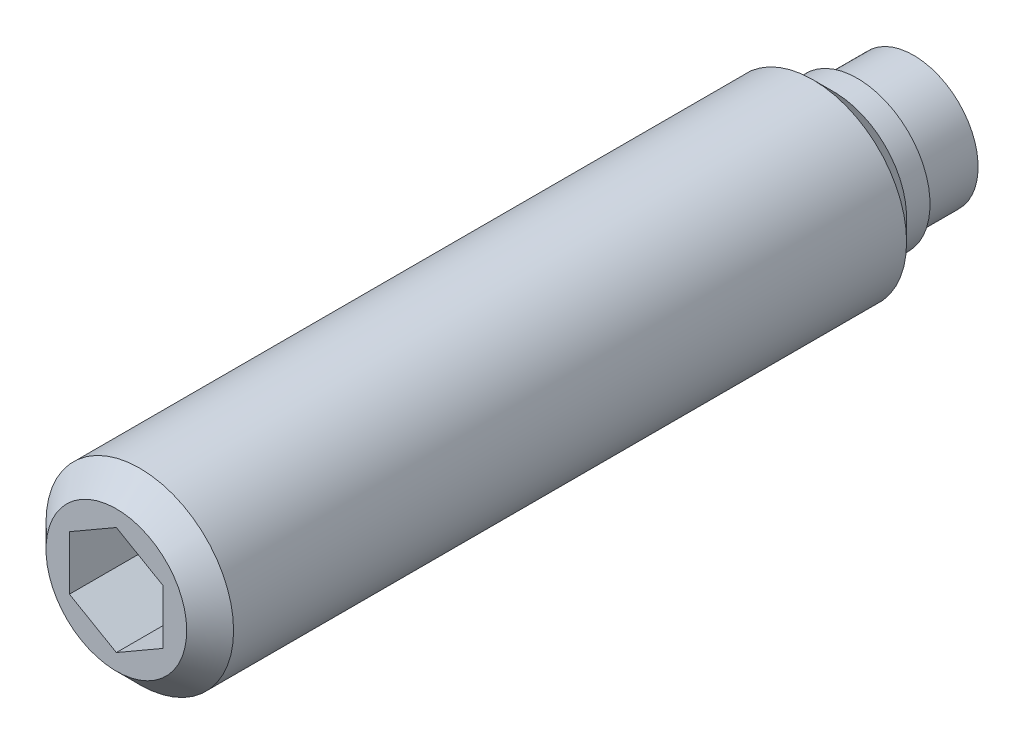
ISO-10303-21;
HEADER;
FILE_DESCRIPTION(('STEP AP214'),'2;1');
FILE_NAME('part.step','',(''),(''),'','','');
FILE_SCHEMA(('AUTOMOTIVE_DESIGN { 1 0 10303 214 1 1 1 1 }'));
ENDSEC;
DATA;
#1=APPLICATION_CONTEXT('core data for automotive mechanical design processes');
#2=APPLICATION_PROTOCOL_DEFINITION('international standard','automotive_design',2000,#1);
#3=PRODUCT_CONTEXT('',#1,'mechanical');
#4=PRODUCT('Part','Part','',(#3));
#5=PRODUCT_RELATED_PRODUCT_CATEGORY('part','',(#4));
#6=PRODUCT_DEFINITION_FORMATION('','',#4);
#7=PRODUCT_DEFINITION_CONTEXT('part definition',#1,'design');
#8=PRODUCT_DEFINITION('design','',#6,#7);
#9=PRODUCT_DEFINITION_SHAPE('','',#8);
#10=(LENGTH_UNIT() NAMED_UNIT(*) SI_UNIT(.MILLI.,.METRE.));
#11=(NAMED_UNIT(*) PLANE_ANGLE_UNIT() SI_UNIT($,.RADIAN.));
#12=(NAMED_UNIT(*) SI_UNIT($,.STERADIAN.) SOLID_ANGLE_UNIT());
#13=UNCERTAINTY_MEASURE_WITH_UNIT(LENGTH_MEASURE(1.E-05),#10,'distance_accuracy_value','');
#14=(GEOMETRIC_REPRESENTATION_CONTEXT(3) GLOBAL_UNCERTAINTY_ASSIGNED_CONTEXT((#13)) GLOBAL_UNIT_ASSIGNED_CONTEXT((#10,
#11,#12)) REPRESENTATION_CONTEXT('',''));
#15=CARTESIAN_POINT('',(0.,0.,0.));
#16=DIRECTION('',(0.,0.,1.));
#17=DIRECTION('',(1.,0.,0.));
#18=AXIS2_PLACEMENT_3D('',#15,#16,#17);
#19=CARTESIAN_POINT('',(0.,3.1,3.2));
#20=DIRECTION('',(0.,0.,1.));
#21=DIRECTION('',(1.,0.,0.));
#22=AXIS2_PLACEMENT_3D('',#19,#20,#21);
#23=PLANE('',#22);
#24=CARTESIAN_POINT('',(0.,0.,3.2));
#25=DIRECTION('',(0.,0.,-1.));
#26=DIRECTION('',(-1.,0.,0.));
#27=AXIS2_PLACEMENT_3D('',#24,#25,#26);
#28=CIRCLE('',#27,2.75);
#29=CARTESIAN_POINT('',(-2.75000000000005,0.,3.2));
#30=VERTEX_POINT('',#29);
#31=EDGE_CURVE('E124',#30,#30,#28,.T.);
#32=ORIENTED_EDGE('',*,*,#31,.F.);
#33=EDGE_LOOP('',(#32));
#34=FACE_BOUND('',#33,.T.);
#35=CARTESIAN_POINT('',(0.,0.,3.2));
#36=DIRECTION('',(0.,0.,-1.));
#37=DIRECTION('',(-1.,0.,0.));
#38=AXIS2_PLACEMENT_3D('',#35,#36,#37);
#39=CIRCLE('',#38,3.1);
#40=CARTESIAN_POINT('',(-3.10000000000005,0.,3.2));
#41=VERTEX_POINT('',#40);
#42=EDGE_CURVE('E127',#41,#41,#39,.T.);
#43=ORIENTED_EDGE('',*,*,#42,.T.);
#44=EDGE_LOOP('',(#43));
#45=FACE_BOUND('',#44,.T.);
#46=ADVANCED_FACE('F14',(#34,#45),#23,.F.);
#47=CARTESIAN_POINT('',(0.,0.,3.2));
#48=DIRECTION('',(0.,0.,-1.));
#49=DIRECTION('',(-1.,0.,0.));
#50=AXIS2_PLACEMENT_3D('',#47,#48,#49);
#51=CYLINDRICAL_SURFACE('',#50,4.);
#52=CARTESIAN_POINT('',(0.,0.,33.8));
#53=DIRECTION('',(0.,0.,1.));
#54=DIRECTION('',(1.,0.,0.));
#55=AXIS2_PLACEMENT_3D('',#52,#53,#54);
#56=CIRCLE('',#55,4.);
#57=CARTESIAN_POINT('',(3.99999999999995,0.,33.8));
#58=VERTEX_POINT('',#57);
#59=EDGE_CURVE('E9',#58,#58,#56,.F.);
#60=ORIENTED_EDGE('',*,*,#59,.T.);
#61=EDGE_LOOP('',(#60));
#62=FACE_BOUND('',#61,.T.);
#63=CARTESIAN_POINT('',(0.,0.,5.1));
#64=DIRECTION('',(0.,0.,-1.));
#65=DIRECTION('',(-1.,0.,0.));
#66=AXIS2_PLACEMENT_3D('',#63,#64,#65);
#67=CIRCLE('',#66,4.);
#68=CARTESIAN_POINT('',(-4.00000000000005,0.,5.1));
#69=VERTEX_POINT('',#68);
#70=EDGE_CURVE('E133',#69,#69,#67,.T.);
#71=ORIENTED_EDGE('',*,*,#70,.F.);
#72=EDGE_LOOP('',(#71));
#73=FACE_BOUND('',#72,.T.);
#74=ADVANCED_FACE('F151',(#62,#73),#51,.T.);
#75=CARTESIAN_POINT('',(0.,0.,5.1));
#76=DIRECTION('',(0.,0.,1.));
#77=DIRECTION('',(1.,0.,0.));
#78=AXIS2_PLACEMENT_3D('',#75,#76,#77);
#79=CONICAL_SURFACE('',#78,4.,0.785398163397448);
#80=CARTESIAN_POINT('',(0.,0.,4.2));
#81=DIRECTION('',(0.,0.,-1.));
#82=DIRECTION('',(-1.,0.,0.));
#83=AXIS2_PLACEMENT_3D('',#80,#81,#82);
#84=CIRCLE('',#83,3.1);
#85=CARTESIAN_POINT('',(-3.10000000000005,0.,4.2));
#86=VERTEX_POINT('',#85);
#87=EDGE_CURVE('E130',#86,#86,#84,.T.);
#88=ORIENTED_EDGE('',*,*,#87,.F.);
#89=EDGE_LOOP('',(#88));
#90=FACE_BOUND('',#89,.T.);
#91=ORIENTED_EDGE('',*,*,#70,.T.);
#92=EDGE_LOOP('',(#91));
#93=FACE_BOUND('',#92,.T.);
#94=ADVANCED_FACE('F158',(#90,#93),#79,.T.);
#95=CARTESIAN_POINT('',(0.,0.,3.2));
#96=DIRECTION('',(0.,0.,-1.));
#97=DIRECTION('',(-1.,0.,0.));
#98=AXIS2_PLACEMENT_3D('',#95,#96,#97);
#99=CYLINDRICAL_SURFACE('',#98,3.1);
#100=ORIENTED_EDGE('',*,*,#42,.F.);
#101=EDGE_LOOP('',(#100));
#102=FACE_BOUND('',#101,.T.);
#103=ORIENTED_EDGE('',*,*,#87,.T.);
#104=EDGE_LOOP('',(#103));
#105=FACE_BOUND('',#104,.T.);
#106=ADVANCED_FACE('F166',(#102,#105),#99,.T.);
#107=CARTESIAN_POINT('',(0.,0.,0.));
#108=DIRECTION('',(0.,0.,-1.));
#109=DIRECTION('',(-1.,0.,0.));
#110=AXIS2_PLACEMENT_3D('',#107,#108,#109);
#111=CYLINDRICAL_SURFACE('',#110,2.75);
#112=CARTESIAN_POINT('',(0.,0.,0.8));
#113=DIRECTION('',(0.,0.,-1.));
#114=DIRECTION('',(-1.,0.,0.));
#115=AXIS2_PLACEMENT_3D('',#112,#113,#114);
#116=CIRCLE('',#115,2.75);
#117=CARTESIAN_POINT('',(-2.75000000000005,0.,0.8));
#118=VERTEX_POINT('',#117);
#119=EDGE_CURVE('E114',#118,#118,#116,.T.);
#120=ORIENTED_EDGE('',*,*,#119,.F.);
#121=EDGE_LOOP('',(#120));
#122=FACE_BOUND('',#121,.T.);
#123=ORIENTED_EDGE('',*,*,#31,.T.);
#124=EDGE_LOOP('',(#123));
#125=FACE_BOUND('',#124,.T.);
#126=ADVANCED_FACE('F164',(#122,#125),#111,.T.);
#127=CARTESIAN_POINT('',(-0.0368577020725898,0.,4.99986414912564));
#128=DIRECTION('',(0.,-1.,0.));
#129=DIRECTION('',(-1.,0.,0.));
#130=AXIS2_PLACEMENT_3D('',#127,#128,#129);
#131=CIRCLE('',#130,4.99999999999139);
#132=TRIMMED_CURVE('',#131,(PARAMETER_VALUE(-1.57816793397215)),
(PARAMETER_VALUE(1.57816793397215)),.T.,.PARAMETER.);
#133=CARTESIAN_POINT('',(0.,0.,4.99986414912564));
#134=DIRECTION('',(0.,0.,-1.));
#135=AXIS1_PLACEMENT('',#133,#134);
#136=SURFACE_OF_REVOLUTION('',#132,#135);
#137=ORIENTED_EDGE('',*,*,#119,.T.);
#138=EDGE_LOOP('',(#137));
#139=FACE_BOUND('',#138,.T.);
#140=CARTESIAN_POINT('',(0.,0.,0.));
#141=VERTEX_POINT('',#140);
#142=VERTEX_LOOP('',#141);
#143=FACE_BOUND('',#142,.T.);
#144=ADVANCED_FACE('F198',(#139,#143),#136,.T.);
#145=CARTESIAN_POINT('',(0.,0.,34.8));
#146=DIRECTION('',(0.,0.,1.));
#147=DIRECTION('',(1.,0.,0.));
#148=AXIS2_PLACEMENT_3D('',#145,#146,#147);
#149=PLANE('',#148);
#150=CARTESIAN_POINT('',(0.,0.,34.8));
#151=DIRECTION('',(0.,0.,1.));
#152=DIRECTION('',(1.,0.,0.));
#153=AXIS2_PLACEMENT_3D('',#150,#151,#152);
#154=CIRCLE('',#153,3.);
#155=CARTESIAN_POINT('',(2.99999999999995,0.,34.8));
#156=VERTEX_POINT('',#155);
#157=EDGE_CURVE('E22',#156,#156,#154,.T.);
#158=ORIENTED_EDGE('',*,*,#157,.T.);
#159=EDGE_LOOP('',(#158));
#160=FACE_BOUND('',#159,.T.);
#161=DIRECTION('',(-0.866025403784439,0.5,0.));
#162=VECTOR('',#161,1.);
#163=CARTESIAN_POINT('',(2.,1.15470053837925,34.8));
#164=LINE('',#163,#162);
#165=CARTESIAN_POINT('',(2.,1.15470053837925,34.8));
#166=VERTEX_POINT('',#165);
#167=CARTESIAN_POINT('',(0.,2.30940107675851,34.8));
#168=VERTEX_POINT('',#167);
#169=EDGE_CURVE('E29',#166,#168,#164,.T.);
#170=ORIENTED_EDGE('',*,*,#169,.F.);
#171=DIRECTION('',(0.,1.,0.));
#172=VECTOR('',#171,1.);
#173=CARTESIAN_POINT('',(2.,-1.15470053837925,34.8));
#174=LINE('',#173,#172);
#175=CARTESIAN_POINT('',(2.,-1.15470053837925,34.8));
#176=VERTEX_POINT('',#175);
#177=EDGE_CURVE('E88',#176,#166,#174,.T.);
#178=ORIENTED_EDGE('',*,*,#177,.F.);
#179=DIRECTION('',(0.866025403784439,0.5,0.));
#180=VECTOR('',#179,1.);
#181=CARTESIAN_POINT('',(0.,-2.30940107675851,34.8));
#182=LINE('',#181,#180);
#183=CARTESIAN_POINT('',(0.,-2.30940107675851,34.8));
#184=VERTEX_POINT('',#183);
#185=EDGE_CURVE('E91',#184,#176,#182,.T.);
#186=ORIENTED_EDGE('',*,*,#185,.F.);
#187=DIRECTION('',(0.866025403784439,-0.5,0.));
#188=VECTOR('',#187,1.);
#189=CARTESIAN_POINT('',(-2.,-1.15470053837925,34.8));
#190=LINE('',#189,#188);
#191=CARTESIAN_POINT('',(-2.,-1.15470053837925,34.8));
#192=VERTEX_POINT('',#191);
#193=EDGE_CURVE('E107',#192,#184,#190,.T.);
#194=ORIENTED_EDGE('',*,*,#193,.F.);
#195=DIRECTION('',(0.,-1.,0.));
#196=VECTOR('',#195,1.);
#197=CARTESIAN_POINT('',(-2.,1.15470053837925,34.8));
#198=LINE('',#197,#196);
#199=CARTESIAN_POINT('',(-2.,1.15470053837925,34.8));
#200=VERTEX_POINT('',#199);
#201=EDGE_CURVE('E104',#200,#192,#198,.T.);
#202=ORIENTED_EDGE('',*,*,#201,.F.);
#203=DIRECTION('',(-0.866025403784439,-0.5,0.));
#204=VECTOR('',#203,1.);
#205=CARTESIAN_POINT('',(0.,2.30940107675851,34.8));
#206=LINE('',#205,#204);
#207=EDGE_CURVE('E102',#168,#200,#206,.T.);
#208=ORIENTED_EDGE('',*,*,#207,.F.);
#209=EDGE_LOOP('',(#170,#178,#186,#194,#202,#208));
#210=FACE_BOUND('',#209,.T.);
#211=ADVANCED_FACE('F138',(#160,#210),#149,.T.);
#212=CARTESIAN_POINT('',(2.,1.15470053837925,30.8));
#213=DIRECTION('',(0.5,0.866025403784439,0.));
#214=DIRECTION('',(-0.866025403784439,0.5,0.));
#215=AXIS2_PLACEMENT_3D('',#212,#213,#214);
#216=PLANE('',#215);
#217=ORIENTED_EDGE('',*,*,#169,.T.);
#218=DIRECTION('',(0.,0.,1.));
#219=VECTOR('',#218,1.);
#220=CARTESIAN_POINT('',(0.,2.30940107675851,30.8));
#221=LINE('',#220,#219);
#222=CARTESIAN_POINT('',(0.,2.30940107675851,30.8));
#223=VERTEX_POINT('',#222);
#224=EDGE_CURVE('E65',#223,#168,#221,.T.);
#225=ORIENTED_EDGE('',*,*,#224,.F.);
#226=DIRECTION('',(-0.866025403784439,0.5,0.));
#227=VECTOR('',#226,1.);
#228=CARTESIAN_POINT('',(2.,1.15470053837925,30.8));
#229=LINE('',#228,#227);
#230=CARTESIAN_POINT('',(2.,1.15470053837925,30.8));
#231=VERTEX_POINT('',#230);
#232=EDGE_CURVE('E69',#231,#223,#229,.T.);
#233=ORIENTED_EDGE('',*,*,#232,.F.);
#234=DIRECTION('',(0.,0.,1.));
#235=VECTOR('',#234,1.);
#236=CARTESIAN_POINT('',(2.,1.15470053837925,30.8));
#237=LINE('',#236,#235);
#238=EDGE_CURVE('E112',#231,#166,#237,.T.);
#239=ORIENTED_EDGE('',*,*,#238,.T.);
#240=EDGE_LOOP('',(#217,#225,#233,#239));
#241=FACE_BOUND('',#240,.T.);
#242=ADVANCED_FACE('F67',(#241),#216,.F.);
#243=CARTESIAN_POINT('',(2.,-1.15470053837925,30.8));
#244=DIRECTION('',(1.,0.,0.));
#245=DIRECTION('',(0.,0.,-1.));
#246=AXIS2_PLACEMENT_3D('',#243,#244,#245);
#247=PLANE('',#246);
#248=ORIENTED_EDGE('',*,*,#177,.T.);
#249=ORIENTED_EDGE('',*,*,#238,.F.);
#250=DIRECTION('',(0.,1.,0.));
#251=VECTOR('',#250,1.);
#252=CARTESIAN_POINT('',(2.,-1.15470053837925,30.8));
#253=LINE('',#252,#251);
#254=CARTESIAN_POINT('',(2.,-1.15470053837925,30.8));
#255=VERTEX_POINT('',#254);
#256=EDGE_CURVE('E75',#255,#231,#253,.T.);
#257=ORIENTED_EDGE('',*,*,#256,.F.);
#258=DIRECTION('',(0.,0.,1.));
#259=VECTOR('',#258,1.);
#260=CARTESIAN_POINT('',(2.,-1.15470053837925,30.8));
#261=LINE('',#260,#259);
#262=EDGE_CURVE('E115',#255,#176,#261,.T.);
#263=ORIENTED_EDGE('',*,*,#262,.T.);
#264=EDGE_LOOP('',(#248,#249,#257,#263));
#265=FACE_BOUND('',#264,.T.);
#266=ADVANCED_FACE('F220',(#265),#247,.F.);
#267=CARTESIAN_POINT('',(0.,-2.30940107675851,30.8));
#268=DIRECTION('',(0.5,-0.866025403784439,0.));
#269=DIRECTION('',(0.866025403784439,0.5,0.));
#270=AXIS2_PLACEMENT_3D('',#267,#268,#269);
#271=PLANE('',#270);
#272=ORIENTED_EDGE('',*,*,#185,.T.);
#273=ORIENTED_EDGE('',*,*,#262,.F.);
#274=DIRECTION('',(0.866025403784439,0.5,0.));
#275=VECTOR('',#274,1.);
#276=CARTESIAN_POINT('',(0.,-2.30940107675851,30.8));
#277=LINE('',#276,#275);
#278=CARTESIAN_POINT('',(0.,-2.30940107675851,30.8));
#279=VERTEX_POINT('',#278);
#280=EDGE_CURVE('E98',#279,#255,#277,.T.);
#281=ORIENTED_EDGE('',*,*,#280,.F.);
#282=DIRECTION('',(0.,0.,1.));
#283=VECTOR('',#282,1.);
#284=CARTESIAN_POINT('',(0.,-2.30940107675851,30.8));
#285=LINE('',#284,#283);
#286=EDGE_CURVE('E117',#279,#184,#285,.T.);
#287=ORIENTED_EDGE('',*,*,#286,.T.);
#288=EDGE_LOOP('',(#272,#273,#281,#287));
#289=FACE_BOUND('',#288,.T.);
#290=ADVANCED_FACE('F228',(#289),#271,.F.);
#291=CARTESIAN_POINT('',(-2.,-1.15470053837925,30.8));
#292=DIRECTION('',(-0.5,-0.866025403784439,0.));
#293=DIRECTION('',(0.866025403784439,-0.5,0.));
#294=AXIS2_PLACEMENT_3D('',#291,#292,#293);
#295=PLANE('',#294);
#296=ORIENTED_EDGE('',*,*,#193,.T.);
#297=ORIENTED_EDGE('',*,*,#286,.F.);
#298=DIRECTION('',(0.866025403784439,-0.5,0.));
#299=VECTOR('',#298,1.);
#300=CARTESIAN_POINT('',(-2.,-1.15470053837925,30.8));
#301=LINE('',#300,#299);
#302=CARTESIAN_POINT('',(-2.,-1.15470053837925,30.8));
#303=VERTEX_POINT('',#302);
#304=EDGE_CURVE('E95',#303,#279,#301,.T.);
#305=ORIENTED_EDGE('',*,*,#304,.F.);
#306=DIRECTION('',(0.,0.,1.));
#307=VECTOR('',#306,1.);
#308=CARTESIAN_POINT('',(-2.,-1.15470053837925,30.8));
#309=LINE('',#308,#307);
#310=EDGE_CURVE('E119',#303,#192,#309,.T.);
#311=ORIENTED_EDGE('',*,*,#310,.T.);
#312=EDGE_LOOP('',(#296,#297,#305,#311));
#313=FACE_BOUND('',#312,.T.);
#314=ADVANCED_FACE('F237',(#313),#295,.F.);
#315=CARTESIAN_POINT('',(-2.,1.15470053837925,30.8));
#316=DIRECTION('',(-1.,0.,0.));
#317=DIRECTION('',(0.,0.,1.));
#318=AXIS2_PLACEMENT_3D('',#315,#316,#317);
#319=PLANE('',#318);
#320=ORIENTED_EDGE('',*,*,#201,.T.);
#321=ORIENTED_EDGE('',*,*,#310,.F.);
#322=DIRECTION('',(0.,-1.,0.));
#323=VECTOR('',#322,1.);
#324=CARTESIAN_POINT('',(-2.,1.15470053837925,30.8));
#325=LINE('',#324,#323);
#326=CARTESIAN_POINT('',(-2.,1.15470053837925,30.8));
#327=VERTEX_POINT('',#326);
#328=EDGE_CURVE('E83',#327,#303,#325,.T.);
#329=ORIENTED_EDGE('',*,*,#328,.F.);
#330=DIRECTION('',(0.,0.,1.));
#331=VECTOR('',#330,1.);
#332=CARTESIAN_POINT('',(-2.,1.15470053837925,30.8));
#333=LINE('',#332,#331);
#334=EDGE_CURVE('E74',#327,#200,#333,.T.);
#335=ORIENTED_EDGE('',*,*,#334,.T.);
#336=EDGE_LOOP('',(#320,#321,#329,#335));
#337=FACE_BOUND('',#336,.T.);
#338=ADVANCED_FACE('F246',(#337),#319,.F.);
#339=CARTESIAN_POINT('',(0.,2.30940107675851,30.8));
#340=DIRECTION('',(-0.5,0.866025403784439,0.));
#341=DIRECTION('',(-0.866025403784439,-0.5,0.));
#342=AXIS2_PLACEMENT_3D('',#339,#340,#341);
#343=PLANE('',#342);
#344=ORIENTED_EDGE('',*,*,#207,.T.);
#345=ORIENTED_EDGE('',*,*,#334,.F.);
#346=DIRECTION('',(-0.866025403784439,-0.5,0.));
#347=VECTOR('',#346,1.);
#348=CARTESIAN_POINT('',(0.,2.30940107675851,30.8));
#349=LINE('',#348,#347);
#350=EDGE_CURVE('E78',#223,#327,#349,.T.);
#351=ORIENTED_EDGE('',*,*,#350,.F.);
#352=ORIENTED_EDGE('',*,*,#224,.T.);
#353=EDGE_LOOP('',(#344,#345,#351,#352));
#354=FACE_BOUND('',#353,.T.);
#355=ADVANCED_FACE('F79',(#354),#343,.F.);
#356=CARTESIAN_POINT('',(0.,0.,30.8));
#357=DIRECTION('',(0.,0.,1.));
#358=DIRECTION('',(1.,0.,0.));
#359=AXIS2_PLACEMENT_3D('',#356,#357,#358);
#360=PLANE('',#359);
#361=ORIENTED_EDGE('',*,*,#232,.T.);
#362=ORIENTED_EDGE('',*,*,#350,.T.);
#363=ORIENTED_EDGE('',*,*,#328,.T.);
#364=ORIENTED_EDGE('',*,*,#304,.T.);
#365=ORIENTED_EDGE('',*,*,#280,.T.);
#366=ORIENTED_EDGE('',*,*,#256,.T.);
#367=EDGE_LOOP('',(#361,#362,#363,#364,#365,#366));
#368=FACE_BOUND('',#367,.T.);
#369=ADVANCED_FACE('F85',(#368),#360,.T.);
#370=CARTESIAN_POINT('',(0.,0.,34.8));
#371=DIRECTION('',(0.,0.,-1.));
#372=DIRECTION('',(-1.,0.,0.));
#373=AXIS2_PLACEMENT_3D('',#370,#371,#372);
#374=CONICAL_SURFACE('',#373,3.,0.785398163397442);
#375=ORIENTED_EDGE('',*,*,#59,.F.);
#376=EDGE_LOOP('',(#375));
#377=FACE_BOUND('',#376,.T.);
#378=ORIENTED_EDGE('',*,*,#157,.F.);
#379=EDGE_LOOP('',(#378));
#380=FACE_BOUND('',#379,.T.);
#381=ADVANCED_FACE('F16',(#377,#380),#374,.T.);
#382=CLOSED_SHELL('',(#46,#74,#94,#106,#126,#144,#211,#242,#266,#290,#314,#338,#355,#369,#381));
#383=MANIFOLD_SOLID_BREP('B1',#382);
#384=ADVANCED_BREP_SHAPE_REPRESENTATION('',(#18,#383),#14);
#385=SHAPE_DEFINITION_REPRESENTATION(#9,#384);
ENDSEC;
END-ISO-10303-21;
